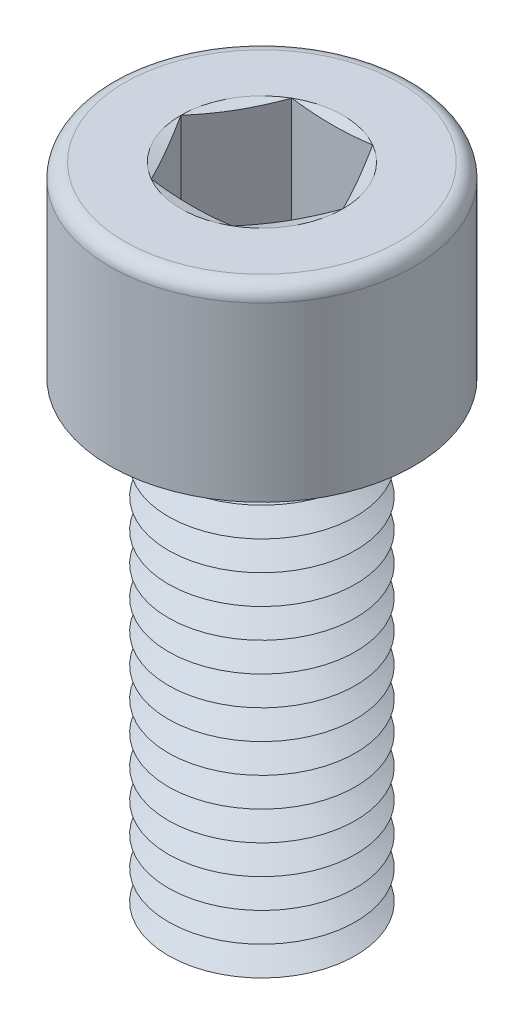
from build123d import *

# Parameters (mm, degrees)
SKETCH1_R       = 4
EXTRUDE1_DEPTH  = 20
SKETCH2_R       = 6.5
EXTRUDE2_DEPTH  = 8
EXTRUDE3_DEPTH  = 6
FILLET1_R       = 0.625
LPATTERN1_COUNT = 16
LPATTERN1_PITCH = 1.25


with BuildPart() as part:
    # Sketch1 → Extrude1 (new body)
    with BuildSketch(Plane(origin=(0, 0, 0), x_dir=(1, 0, 0), z_dir=(0, 1, 0))):
        with Locations(Location((0, 0, 0), (0, 0, 270))):
            Circle(SKETCH1_R)
    extrude(amount=EXTRUDE1_DEPTH)

    # Sketch2 → Extrude2 (add)
    with BuildSketch(Plane(origin=(0, 20, 0), x_dir=(1, 0, 0), z_dir=(0, 1, 0))):
        with Locations(Location((0, 0, 0), (0, 0, 270))):
            Circle(SKETCH2_R)
    extrude(amount=EXTRUDE2_DEPTH)

    # Sketch3 → Extrude3 (cut)
    with BuildSketch(Plane(origin=(0, 28, 0), x_dir=(1, 0, 0), z_dir=(0, 1, 0))):
        Polygon((1.732050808, 3), (-1.732050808, 3), (-3.464101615, 0), (-1.732050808, -3), (1.732050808, -3), (3.464101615, 0), align=None)
    extrude(amount=-EXTRUDE3_DEPTH, mode=Mode.SUBTRACT)

    # Fillet1
    fillet1_edges = [part.edges().sort_by_distance(p)[0] for p in [
        (0, 28, -6.5),
    ]]
    fillet(fillet1_edges, radius=FILLET1_R)

    # Sketch4 → Cut-Revolve1 (revolve, cut)
    with BuildSketch(Plane(origin=(0, 0, 0), x_dir=(0, 0, -1), z_dir=(1, 0, 0))):
        Polygon((-3, 22), (0, 22), (0, 20.267949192), align=None)
    revolve(axis=Axis((0, 22, 0), (0, -1, 0)), mode=Mode.SUBTRACT)

    # Sketch5 → Cut-Revolve2 (revolve, cut)
    with BuildSketch(Plane.XY, mode=Mode.PRIVATE) as cut_revolve2_sk:
        Polygon((-4, 0.625), (-4, -0.625), (-2.917468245, 0), align=None)
    cut_revolve2 = revolve(cut_revolve2_sk.sketch.rotate(Axis((0, 20, 0), (0, -1, 0)), 270), axis=Axis((0, 20, 0), (0, -1, 0)), mode=Mode.SUBTRACT)

    # LPattern1: Cut-Revolve2 ×16
    with Locations(*[(0, i * LPATTERN1_PITCH, 0) for i in range(1, LPATTERN1_COUNT)]):
        add(cut_revolve2, mode=Mode.SUBTRACT)

    # Extrude4 cone 1 section (on through the dimple's axis) → Extrude4 (revolve, cut)
    with BuildSketch(Plane(origin=(0, 28, 0), x_dir=(0, 0, 1), z_dir=(1, 0, 0))):
        Polygon((0, 0), (3.464101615, 0), (0, 0.92820323), align=None)
    revolve(axis=Axis((0, 28, 0), (0, -1, 0)), mode=Mode.SUBTRACT)


solid = part.part
